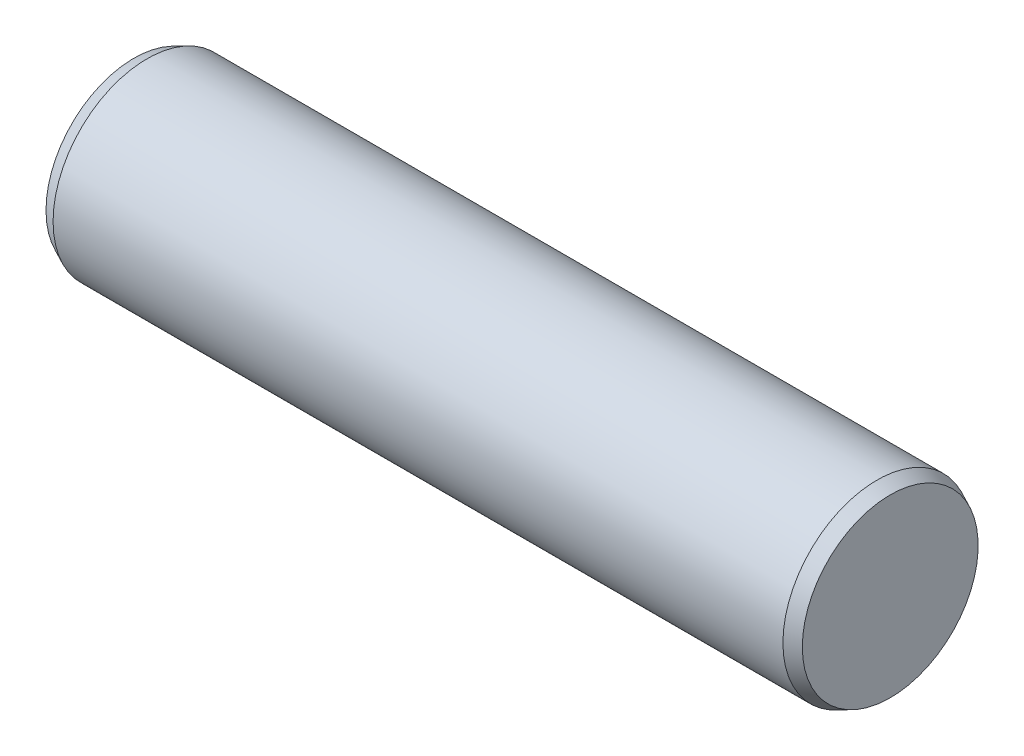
ISO-10303-21;
HEADER;
FILE_DESCRIPTION(('STEP AP214'),'2;1');
FILE_NAME('part.step','',(''),(''),'','','');
FILE_SCHEMA(('AUTOMOTIVE_DESIGN { 1 0 10303 214 1 1 1 1 }'));
ENDSEC;
DATA;
#1=APPLICATION_CONTEXT('core data for automotive mechanical design processes');
#2=APPLICATION_PROTOCOL_DEFINITION('international standard','automotive_design',2000,#1);
#3=PRODUCT_CONTEXT('',#1,'mechanical');
#4=PRODUCT('Part','Part','',(#3));
#5=PRODUCT_RELATED_PRODUCT_CATEGORY('part','',(#4));
#6=PRODUCT_DEFINITION_FORMATION('','',#4);
#7=PRODUCT_DEFINITION_CONTEXT('part definition',#1,'design');
#8=PRODUCT_DEFINITION('design','',#6,#7);
#9=PRODUCT_DEFINITION_SHAPE('','',#8);
#10=(LENGTH_UNIT() NAMED_UNIT(*) SI_UNIT(.MILLI.,.METRE.));
#11=(NAMED_UNIT(*) PLANE_ANGLE_UNIT() SI_UNIT($,.RADIAN.));
#12=(NAMED_UNIT(*) SI_UNIT($,.STERADIAN.) SOLID_ANGLE_UNIT());
#13=UNCERTAINTY_MEASURE_WITH_UNIT(LENGTH_MEASURE(1.E-05),#10,'distance_accuracy_value','');
#14=(GEOMETRIC_REPRESENTATION_CONTEXT(3) GLOBAL_UNCERTAINTY_ASSIGNED_CONTEXT((#13)) GLOBAL_UNIT_ASSIGNED_CONTEXT((#10,
#11,#12)) REPRESENTATION_CONTEXT('',''));
#15=CARTESIAN_POINT('',(0.,0.,0.));
#16=DIRECTION('',(0.,0.,1.));
#17=DIRECTION('',(1.,0.,0.));
#18=AXIS2_PLACEMENT_3D('',#15,#16,#17);
#19=CARTESIAN_POINT('',(0.,11.8099449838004,0.));
#20=DIRECTION('',(1.,0.,0.));
#21=DIRECTION('',(0.,0.,-1.));
#22=AXIS2_PLACEMENT_3D('',#19,#20,#21);
#23=PLANE('',#22);
#24=CARTESIAN_POINT('',(0.,0.,0.));
#25=DIRECTION('',(-1.,0.,0.));
#26=DIRECTION('',(0.,0.,1.));
#27=AXIS2_PLACEMENT_3D('',#24,#25,#26);
#28=CIRCLE('',#27,11.8099449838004);
#29=CARTESIAN_POINT('',(0.,0.,11.8099449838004));
#30=VERTEX_POINT('',#29);
#31=EDGE_CURVE('E51',#30,#30,#28,.T.);
#32=ORIENTED_EDGE('',*,*,#31,.T.);
#33=EDGE_LOOP('',(#32));
#34=FACE_BOUND('',#33,.T.);
#35=ADVANCED_FACE('F40',(#34),#23,.F.);
#36=CARTESIAN_POINT('',(101.6,0.,0.));
#37=DIRECTION('',(-1.,0.,0.));
#38=DIRECTION('',(0.,0.,1.));
#39=AXIS2_PLACEMENT_3D('',#36,#37,#38);
#40=PLANE('',#39);
#41=CARTESIAN_POINT('',(101.6,0.,0.));
#42=DIRECTION('',(-1.,0.,0.));
#43=DIRECTION('',(0.,0.,1.));
#44=AXIS2_PLACEMENT_3D('',#41,#42,#43);
#45=CIRCLE('',#44,11.8099449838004);
#46=CARTESIAN_POINT('',(101.6,0.,11.8099449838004));
#47=VERTEX_POINT('',#46);
#48=EDGE_CURVE('E10',#47,#47,#45,.T.);
#49=ORIENTED_EDGE('',*,*,#48,.F.);
#50=EDGE_LOOP('',(#49));
#51=FACE_BOUND('',#50,.T.);
#52=ADVANCED_FACE('F72',(#51),#40,.F.);
#53=CARTESIAN_POINT('',(101.6,0.,0.));
#54=DIRECTION('',(-1.,0.,0.));
#55=DIRECTION('',(0.,0.,1.));
#56=AXIS2_PLACEMENT_3D('',#53,#54,#55);
#57=CONICAL_SURFACE('',#56,11.8099449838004,0.436332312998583);
#58=CARTESIAN_POINT('',(99.822,0.,0.));
#59=DIRECTION('',(-1.,0.,0.));
#60=DIRECTION('',(0.,0.,1.));
#61=AXIS2_PLACEMENT_3D('',#58,#59,#60);
#62=CIRCLE('',#61,12.63904);
#63=CARTESIAN_POINT('',(99.822,0.,12.63904));
#64=VERTEX_POINT('',#63);
#65=EDGE_CURVE('E43',#64,#64,#62,.T.);
#66=ORIENTED_EDGE('',*,*,#65,.F.);
#67=EDGE_LOOP('',(#66));
#68=FACE_BOUND('',#67,.T.);
#69=ORIENTED_EDGE('',*,*,#48,.T.);
#70=EDGE_LOOP('',(#69));
#71=FACE_BOUND('',#70,.T.);
#72=ADVANCED_FACE('F68',(#68,#71),#57,.T.);
#73=CARTESIAN_POINT('',(-6.35,0.,0.));
#74=DIRECTION('',(-1.,0.,0.));
#75=DIRECTION('',(0.,0.,1.));
#76=AXIS2_PLACEMENT_3D('',#73,#74,#75);
#77=CYLINDRICAL_SURFACE('',#76,12.63904);
#78=CARTESIAN_POINT('',(1.778,0.,0.));
#79=DIRECTION('',(-1.,0.,0.));
#80=DIRECTION('',(0.,0.,1.));
#81=AXIS2_PLACEMENT_3D('',#78,#79,#80);
#82=CIRCLE('',#81,12.63904);
#83=CARTESIAN_POINT('',(1.778,0.,12.63904));
#84=VERTEX_POINT('',#83);
#85=EDGE_CURVE('E50',#84,#84,#82,.T.);
#86=ORIENTED_EDGE('',*,*,#85,.F.);
#87=EDGE_LOOP('',(#86));
#88=FACE_BOUND('',#87,.T.);
#89=ORIENTED_EDGE('',*,*,#65,.T.);
#90=EDGE_LOOP('',(#89));
#91=FACE_BOUND('',#90,.T.);
#92=ADVANCED_FACE('F62',(#88,#91),#77,.T.);
#93=CARTESIAN_POINT('',(1.778,0.,0.));
#94=DIRECTION('',(1.,0.,0.));
#95=DIRECTION('',(0.,0.,-1.));
#96=AXIS2_PLACEMENT_3D('',#93,#94,#95);
#97=CONICAL_SURFACE('',#96,12.63904,0.436332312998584);
#98=ORIENTED_EDGE('',*,*,#31,.F.);
#99=EDGE_LOOP('',(#98));
#100=FACE_BOUND('',#99,.T.);
#101=ORIENTED_EDGE('',*,*,#85,.T.);
#102=EDGE_LOOP('',(#101));
#103=FACE_BOUND('',#102,.T.);
#104=ADVANCED_FACE('F59',(#100,#103),#97,.T.);
#105=CLOSED_SHELL('',(#35,#52,#72,#92,#104));
#106=MANIFOLD_SOLID_BREP('B2',#105);
#107=ADVANCED_BREP_SHAPE_REPRESENTATION('',(#18,#106),#14);
#108=SHAPE_DEFINITION_REPRESENTATION(#9,#107);
ENDSEC;
END-ISO-10303-21;
